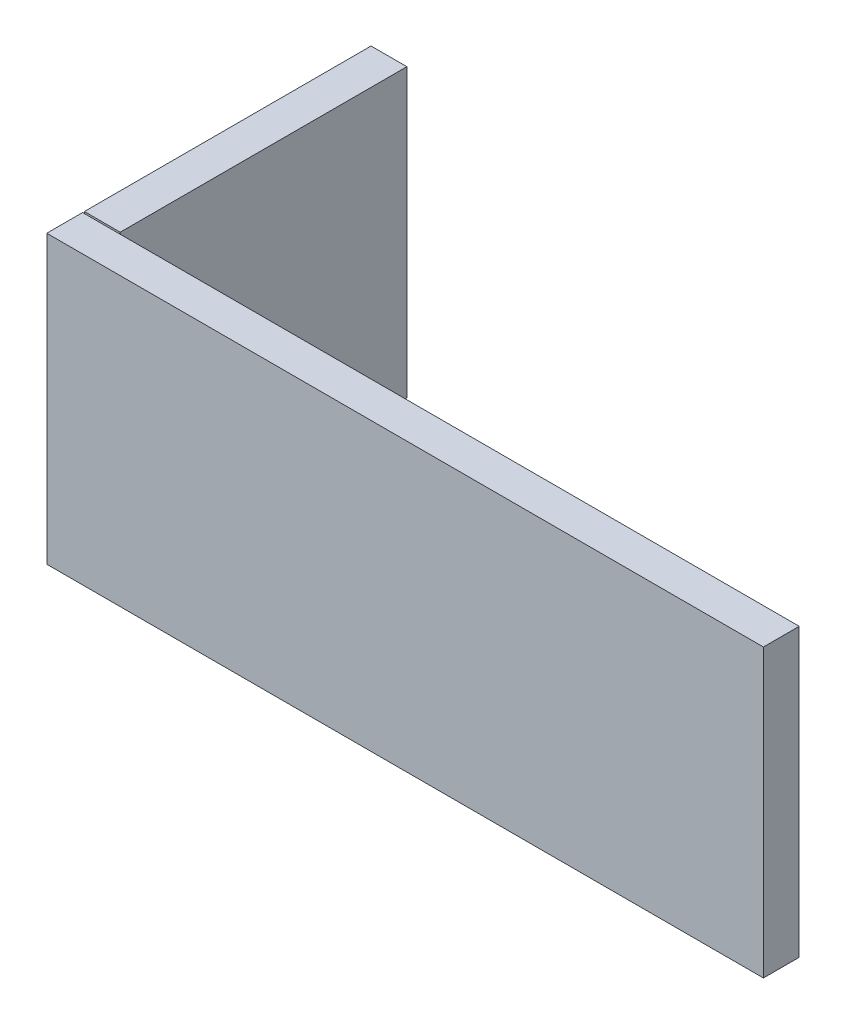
ISO-10303-21;
HEADER;
FILE_DESCRIPTION(('STEP AP214'),'2;1');
FILE_NAME('part.step','',(''),(''),'','','');
FILE_SCHEMA(('AUTOMOTIVE_DESIGN { 1 0 10303 214 1 1 1 1 }'));
ENDSEC;
DATA;
#1=APPLICATION_CONTEXT('core data for automotive mechanical design processes');
#2=APPLICATION_PROTOCOL_DEFINITION('international standard','automotive_design',2000,#1);
#3=PRODUCT_CONTEXT('',#1,'mechanical');
#4=PRODUCT('Part','Part','',(#3));
#5=PRODUCT_RELATED_PRODUCT_CATEGORY('part','',(#4));
#6=PRODUCT_DEFINITION_FORMATION('','',#4);
#7=PRODUCT_DEFINITION_CONTEXT('part definition',#1,'design');
#8=PRODUCT_DEFINITION('design','',#6,#7);
#9=PRODUCT_DEFINITION_SHAPE('','',#8);
#10=(LENGTH_UNIT() NAMED_UNIT(*) SI_UNIT(.MILLI.,.METRE.));
#11=(NAMED_UNIT(*) PLANE_ANGLE_UNIT() SI_UNIT($,.RADIAN.));
#12=(NAMED_UNIT(*) SI_UNIT($,.STERADIAN.) SOLID_ANGLE_UNIT());
#13=UNCERTAINTY_MEASURE_WITH_UNIT(LENGTH_MEASURE(1.E-05),#10,'distance_accuracy_value','');
#14=(GEOMETRIC_REPRESENTATION_CONTEXT(3) GLOBAL_UNCERTAINTY_ASSIGNED_CONTEXT((#13)) GLOBAL_UNIT_ASSIGNED_CONTEXT((#10,
#11,#12)) REPRESENTATION_CONTEXT('',''));
#15=CARTESIAN_POINT('',(0.,0.,0.));
#16=DIRECTION('',(0.,0.,1.));
#17=DIRECTION('',(1.,0.,0.));
#18=AXIS2_PLACEMENT_3D('',#15,#16,#17);
#19=CARTESIAN_POINT('',(0.,101.6,-13.335));
#20=DIRECTION('',(0.,0.,-1.));
#21=DIRECTION('',(-1.,0.,0.));
#22=AXIS2_PLACEMENT_3D('',#19,#20,#21);
#23=PLANE('',#22);
#24=DIRECTION('',(1.,0.,0.));
#25=VECTOR('',#24,1.);
#26=CARTESIAN_POINT('',(0.,0.,-13.335));
#27=LINE('',#26,#25);
#28=CARTESIAN_POINT('',(0.,0.,-13.335));
#29=VERTEX_POINT('',#28);
#30=CARTESIAN_POINT('',(12.7,0.,-13.335));
#31=VERTEX_POINT('',#30);
#32=EDGE_CURVE('E107',#29,#31,#27,.T.);
#33=ORIENTED_EDGE('',*,*,#32,.T.);
#34=DIRECTION('',(0.,-1.,0.));
#35=VECTOR('',#34,1.);
#36=CARTESIAN_POINT('',(12.7,101.6,-13.335));
#37=LINE('',#36,#35);
#38=CARTESIAN_POINT('',(12.7,101.6,-13.335));
#39=VERTEX_POINT('',#38);
#40=EDGE_CURVE('E12',#39,#31,#37,.T.);
#41=ORIENTED_EDGE('',*,*,#40,.F.);
#42=DIRECTION('',(1.,0.,0.));
#43=VECTOR('',#42,1.);
#44=CARTESIAN_POINT('',(0.,101.6,-13.335));
#45=LINE('',#44,#43);
#46=CARTESIAN_POINT('',(0.,101.6,-13.335));
#47=VERTEX_POINT('',#46);
#48=EDGE_CURVE('E93',#47,#39,#45,.T.);
#49=ORIENTED_EDGE('',*,*,#48,.F.);
#50=DIRECTION('',(0.,-1.,0.));
#51=VECTOR('',#50,1.);
#52=CARTESIAN_POINT('',(0.,101.6,-13.335));
#53=LINE('',#52,#51);
#54=EDGE_CURVE('E60',#47,#29,#53,.T.);
#55=ORIENTED_EDGE('',*,*,#54,.T.);
#56=EDGE_LOOP('',(#33,#41,#49,#55));
#57=FACE_BOUND('',#56,.T.);
#58=ADVANCED_FACE('F44',(#57),#23,.F.);
#59=CARTESIAN_POINT('',(12.7,101.6,0.));
#60=DIRECTION('',(-1.,0.,0.));
#61=DIRECTION('',(0.,0.,1.));
#62=AXIS2_PLACEMENT_3D('',#59,#60,#61);
#63=PLANE('',#62);
#64=DIRECTION('',(0.,0.,-1.));
#65=VECTOR('',#64,1.);
#66=CARTESIAN_POINT('',(12.7,0.,0.));
#67=LINE('',#66,#65);
#68=CARTESIAN_POINT('',(12.7,0.,-114.935));
#69=VERTEX_POINT('',#68);
#70=EDGE_CURVE('E98',#31,#69,#67,.T.);
#71=ORIENTED_EDGE('',*,*,#70,.T.);
#72=DIRECTION('',(0.,-1.,0.));
#73=VECTOR('',#72,1.);
#74=CARTESIAN_POINT('',(12.7,101.6,-114.935));
#75=LINE('',#74,#73);
#76=CARTESIAN_POINT('',(12.7,101.6,-114.935));
#77=VERTEX_POINT('',#76);
#78=EDGE_CURVE('E52',#77,#69,#75,.T.);
#79=ORIENTED_EDGE('',*,*,#78,.F.);
#80=DIRECTION('',(0.,0.,-1.));
#81=VECTOR('',#80,1.);
#82=CARTESIAN_POINT('',(12.7,101.6,0.));
#83=LINE('',#82,#81);
#84=EDGE_CURVE('E85',#39,#77,#83,.T.);
#85=ORIENTED_EDGE('',*,*,#84,.F.);
#86=ORIENTED_EDGE('',*,*,#40,.T.);
#87=EDGE_LOOP('',(#71,#79,#85,#86));
#88=FACE_BOUND('',#87,.T.);
#89=ADVANCED_FACE('F97',(#88),#63,.F.);
#90=CARTESIAN_POINT('',(0.,101.6,-114.935));
#91=DIRECTION('',(0.,0.,-1.));
#92=DIRECTION('',(-1.,0.,0.));
#93=AXIS2_PLACEMENT_3D('',#90,#91,#92);
#94=PLANE('',#93);
#95=DIRECTION('',(1.,0.,0.));
#96=VECTOR('',#95,1.);
#97=CARTESIAN_POINT('',(0.,0.,-114.935));
#98=LINE('',#97,#96);
#99=CARTESIAN_POINT('',(0.,0.,-114.935));
#100=VERTEX_POINT('',#99);
#101=EDGE_CURVE('E110',#100,#69,#98,.T.);
#102=ORIENTED_EDGE('',*,*,#101,.F.);
#103=DIRECTION('',(0.,-1.,0.));
#104=VECTOR('',#103,1.);
#105=CARTESIAN_POINT('',(0.,101.6,-114.935));
#106=LINE('',#105,#104);
#107=CARTESIAN_POINT('',(0.,101.6,-114.935));
#108=VERTEX_POINT('',#107);
#109=EDGE_CURVE('E74',#108,#100,#106,.T.);
#110=ORIENTED_EDGE('',*,*,#109,.F.);
#111=DIRECTION('',(1.,0.,0.));
#112=VECTOR('',#111,1.);
#113=CARTESIAN_POINT('',(0.,101.6,-114.935));
#114=LINE('',#113,#112);
#115=EDGE_CURVE('E92',#108,#77,#114,.T.);
#116=ORIENTED_EDGE('',*,*,#115,.T.);
#117=ORIENTED_EDGE('',*,*,#78,.T.);
#118=EDGE_LOOP('',(#102,#110,#116,#117));
#119=FACE_BOUND('',#118,.T.);
#120=ADVANCED_FACE('F101',(#119),#94,.T.);
#121=CARTESIAN_POINT('',(0.,101.6,0.));
#122=DIRECTION('',(-1.,0.,0.));
#123=DIRECTION('',(0.,0.,1.));
#124=AXIS2_PLACEMENT_3D('',#121,#122,#123);
#125=PLANE('',#124);
#126=DIRECTION('',(0.,0.,-1.));
#127=VECTOR('',#126,1.);
#128=CARTESIAN_POINT('',(0.,0.,0.));
#129=LINE('',#128,#127);
#130=EDGE_CURVE('E112',#29,#100,#129,.T.);
#131=ORIENTED_EDGE('',*,*,#130,.F.);
#132=ORIENTED_EDGE('',*,*,#54,.F.);
#133=DIRECTION('',(0.,0.,-1.));
#134=VECTOR('',#133,1.);
#135=CARTESIAN_POINT('',(0.,101.6,0.));
#136=LINE('',#135,#134);
#137=EDGE_CURVE('E102',#47,#108,#136,.T.);
#138=ORIENTED_EDGE('',*,*,#137,.T.);
#139=ORIENTED_EDGE('',*,*,#109,.T.);
#140=EDGE_LOOP('',(#131,#132,#138,#139));
#141=FACE_BOUND('',#140,.T.);
#142=ADVANCED_FACE('F118',(#141),#125,.T.);
#143=CARTESIAN_POINT('',(0.,101.6,0.));
#144=DIRECTION('',(0.,1.,0.));
#145=DIRECTION('',(0.,0.,1.));
#146=AXIS2_PLACEMENT_3D('',#143,#144,#145);
#147=PLANE('',#146);
#148=ORIENTED_EDGE('',*,*,#48,.T.);
#149=ORIENTED_EDGE('',*,*,#84,.T.);
#150=ORIENTED_EDGE('',*,*,#115,.F.);
#151=ORIENTED_EDGE('',*,*,#137,.F.);
#152=EDGE_LOOP('',(#148,#149,#150,#151));
#153=FACE_BOUND('',#152,.T.);
#154=ADVANCED_FACE('F89',(#153),#147,.T.);
#155=CARTESIAN_POINT('',(0.,0.,0.));
#156=DIRECTION('',(0.,1.,0.));
#157=DIRECTION('',(0.,0.,1.));
#158=AXIS2_PLACEMENT_3D('',#155,#156,#157);
#159=PLANE('',#158);
#160=ORIENTED_EDGE('',*,*,#32,.F.);
#161=ORIENTED_EDGE('',*,*,#130,.T.);
#162=ORIENTED_EDGE('',*,*,#101,.T.);
#163=ORIENTED_EDGE('',*,*,#70,.F.);
#164=EDGE_LOOP('',(#160,#161,#162,#163));
#165=FACE_BOUND('',#164,.T.);
#166=ADVANCED_FACE('F117',(#165),#159,.F.);
#167=CLOSED_SHELL('',(#58,#89,#120,#142,#154,#166));
#168=MANIFOLD_SOLID_BREP('B2',#167);
#169=CARTESIAN_POINT('',(0.,101.6,-12.7));
#170=DIRECTION('',(0.,0.,-1.));
#171=DIRECTION('',(-1.,0.,0.));
#172=AXIS2_PLACEMENT_3D('',#169,#170,#171);
#173=PLANE('',#172);
#174=DIRECTION('',(1.,0.,0.));
#175=VECTOR('',#174,1.);
#176=CARTESIAN_POINT('',(0.,0.,-12.7));
#177=LINE('',#176,#175);
#178=CARTESIAN_POINT('',(0.,0.,-12.7));
#179=VERTEX_POINT('',#178);
#180=CARTESIAN_POINT('',(254.,0.,-12.7));
#181=VERTEX_POINT('',#180);
#182=EDGE_CURVE('E230',#179,#181,#177,.T.);
#183=ORIENTED_EDGE('',*,*,#182,.F.);
#184=DIRECTION('',(0.,-1.,0.));
#185=VECTOR('',#184,1.);
#186=CARTESIAN_POINT('',(0.,101.6,-12.7));
#187=LINE('',#186,#185);
#188=CARTESIAN_POINT('',(0.,101.6,-12.7));
#189=VERTEX_POINT('',#188);
#190=EDGE_CURVE('E42',#189,#179,#187,.T.);
#191=ORIENTED_EDGE('',*,*,#190,.F.);
#192=DIRECTION('',(1.,0.,0.));
#193=VECTOR('',#192,1.);
#194=CARTESIAN_POINT('',(0.,101.6,-12.7));
#195=LINE('',#194,#193);
#196=CARTESIAN_POINT('',(254.,101.6,-12.7));
#197=VERTEX_POINT('',#196);
#198=EDGE_CURVE('E224',#189,#197,#195,.T.);
#199=ORIENTED_EDGE('',*,*,#198,.T.);
#200=DIRECTION('',(0.,-1.,0.));
#201=VECTOR('',#200,1.);
#202=CARTESIAN_POINT('',(254.,101.6,-12.7));
#203=LINE('',#202,#201);
#204=EDGE_CURVE('E205',#197,#181,#203,.T.);
#205=ORIENTED_EDGE('',*,*,#204,.T.);
#206=EDGE_LOOP('',(#183,#191,#199,#205));
#207=FACE_BOUND('',#206,.T.);
#208=ADVANCED_FACE('F167',(#207),#173,.T.);
#209=CARTESIAN_POINT('',(0.,101.6,0.));
#210=DIRECTION('',(-1.,0.,0.));
#211=DIRECTION('',(0.,0.,1.));
#212=AXIS2_PLACEMENT_3D('',#209,#210,#211);
#213=PLANE('',#212);
#214=DIRECTION('',(0.,0.,-1.));
#215=VECTOR('',#214,1.);
#216=CARTESIAN_POINT('',(0.,0.,0.));
#217=LINE('',#216,#215);
#218=CARTESIAN_POINT('',(0.,0.,0.));
#219=VERTEX_POINT('',#218);
#220=EDGE_CURVE('E218',#219,#179,#217,.T.);
#221=ORIENTED_EDGE('',*,*,#220,.F.);
#222=DIRECTION('',(0.,-1.,0.));
#223=VECTOR('',#222,1.);
#224=CARTESIAN_POINT('',(0.,101.6,0.));
#225=LINE('',#224,#223);
#226=CARTESIAN_POINT('',(0.,101.6,0.));
#227=VERTEX_POINT('',#226);
#228=EDGE_CURVE('E175',#227,#219,#225,.T.);
#229=ORIENTED_EDGE('',*,*,#228,.F.);
#230=DIRECTION('',(0.,0.,-1.));
#231=VECTOR('',#230,1.);
#232=CARTESIAN_POINT('',(0.,101.6,0.));
#233=LINE('',#232,#231);
#234=EDGE_CURVE('E216',#227,#189,#233,.T.);
#235=ORIENTED_EDGE('',*,*,#234,.T.);
#236=ORIENTED_EDGE('',*,*,#190,.T.);
#237=EDGE_LOOP('',(#221,#229,#235,#236));
#238=FACE_BOUND('',#237,.T.);
#239=ADVANCED_FACE('F214',(#238),#213,.T.);
#240=CARTESIAN_POINT('',(0.,101.6,0.));
#241=DIRECTION('',(0.,0.,-1.));
#242=DIRECTION('',(-1.,0.,0.));
#243=AXIS2_PLACEMENT_3D('',#240,#241,#242);
#244=PLANE('',#243);
#245=DIRECTION('',(1.,0.,0.));
#246=VECTOR('',#245,1.);
#247=CARTESIAN_POINT('',(0.,0.,0.));
#248=LINE('',#247,#246);
#249=CARTESIAN_POINT('',(254.,0.,0.));
#250=VERTEX_POINT('',#249);
#251=EDGE_CURVE('E198',#219,#250,#248,.T.);
#252=ORIENTED_EDGE('',*,*,#251,.T.);
#253=DIRECTION('',(0.,-1.,0.));
#254=VECTOR('',#253,1.);
#255=CARTESIAN_POINT('',(254.,101.6,0.));
#256=LINE('',#255,#254);
#257=CARTESIAN_POINT('',(254.,101.6,0.));
#258=VERTEX_POINT('',#257);
#259=EDGE_CURVE('E219',#258,#250,#256,.T.);
#260=ORIENTED_EDGE('',*,*,#259,.F.);
#261=DIRECTION('',(1.,0.,0.));
#262=VECTOR('',#261,1.);
#263=CARTESIAN_POINT('',(0.,101.6,0.));
#264=LINE('',#263,#262);
#265=EDGE_CURVE('E220',#227,#258,#264,.T.);
#266=ORIENTED_EDGE('',*,*,#265,.F.);
#267=ORIENTED_EDGE('',*,*,#228,.T.);
#268=EDGE_LOOP('',(#252,#260,#266,#267));
#269=FACE_BOUND('',#268,.T.);
#270=ADVANCED_FACE('F221',(#269),#244,.F.);
#271=CARTESIAN_POINT('',(254.,101.6,0.));
#272=DIRECTION('',(-1.,0.,0.));
#273=DIRECTION('',(0.,0.,1.));
#274=AXIS2_PLACEMENT_3D('',#271,#272,#273);
#275=PLANE('',#274);
#276=DIRECTION('',(0.,0.,-1.));
#277=VECTOR('',#276,1.);
#278=CARTESIAN_POINT('',(254.,0.,0.));
#279=LINE('',#278,#277);
#280=EDGE_CURVE('E226',#250,#181,#279,.T.);
#281=ORIENTED_EDGE('',*,*,#280,.T.);
#282=ORIENTED_EDGE('',*,*,#204,.F.);
#283=DIRECTION('',(0.,0.,-1.));
#284=VECTOR('',#283,1.);
#285=CARTESIAN_POINT('',(254.,101.6,0.));
#286=LINE('',#285,#284);
#287=EDGE_CURVE('E183',#258,#197,#286,.T.);
#288=ORIENTED_EDGE('',*,*,#287,.F.);
#289=ORIENTED_EDGE('',*,*,#259,.T.);
#290=EDGE_LOOP('',(#281,#282,#288,#289));
#291=FACE_BOUND('',#290,.T.);
#292=ADVANCED_FACE('F239',(#291),#275,.F.);
#293=CARTESIAN_POINT('',(0.,101.6,0.));
#294=DIRECTION('',(0.,1.,0.));
#295=DIRECTION('',(0.,0.,1.));
#296=AXIS2_PLACEMENT_3D('',#293,#294,#295);
#297=PLANE('',#296);
#298=ORIENTED_EDGE('',*,*,#198,.F.);
#299=ORIENTED_EDGE('',*,*,#234,.F.);
#300=ORIENTED_EDGE('',*,*,#265,.T.);
#301=ORIENTED_EDGE('',*,*,#287,.T.);
#302=EDGE_LOOP('',(#298,#299,#300,#301));
#303=FACE_BOUND('',#302,.T.);
#304=ADVANCED_FACE('F223',(#303),#297,.T.);
#305=CARTESIAN_POINT('',(0.,0.,0.));
#306=DIRECTION('',(0.,1.,0.));
#307=DIRECTION('',(0.,0.,1.));
#308=AXIS2_PLACEMENT_3D('',#305,#306,#307);
#309=PLANE('',#308);
#310=ORIENTED_EDGE('',*,*,#182,.T.);
#311=ORIENTED_EDGE('',*,*,#280,.F.);
#312=ORIENTED_EDGE('',*,*,#251,.F.);
#313=ORIENTED_EDGE('',*,*,#220,.T.);
#314=EDGE_LOOP('',(#310,#311,#312,#313));
#315=FACE_BOUND('',#314,.T.);
#316=ADVANCED_FACE('F241',(#315),#309,.F.);
#317=CLOSED_SHELL('',(#208,#239,#270,#292,#304,#316));
#318=MANIFOLD_SOLID_BREP('B6',#317);
#319=ADVANCED_BREP_SHAPE_REPRESENTATION('',(#18,#168,#318),#14);
#320=SHAPE_DEFINITION_REPRESENTATION(#9,#319);
ENDSEC;
END-ISO-10303-21;
